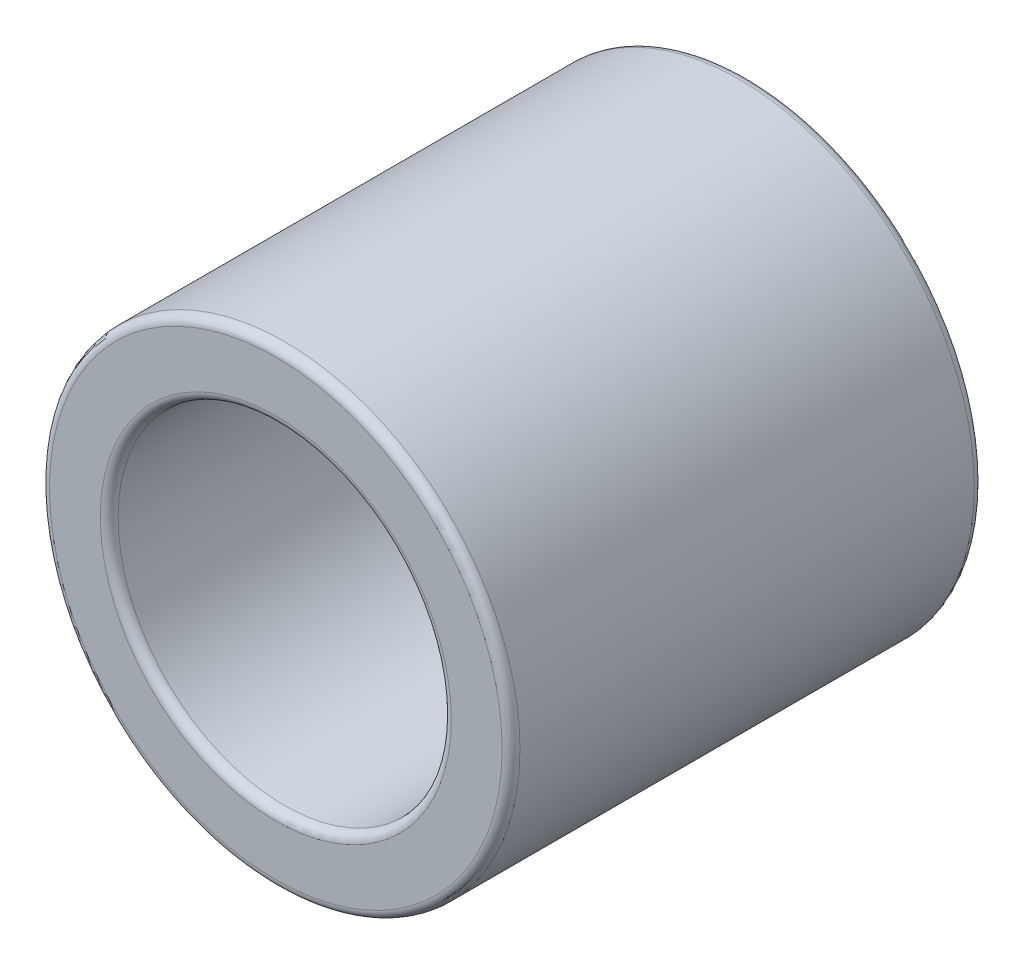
from build123d import *

# Parameters (mm, degrees)
SKETCH1_R           = 3.3528
SKETCH1_R_2         = 2.3749
BOSS_EXTRUDE1_DEPTH = 3.3655
FILLET1_R           = 0.127


with BuildPart() as part:
    # Sketch1 → Boss-Extrude1 (new, symmetric)
    with BuildSketch(Plane.XY):
        Circle(SKETCH1_R)
        Circle(SKETCH1_R_2, mode=Mode.SUBTRACT)
    extrude(amount=BOSS_EXTRUDE1_DEPTH, both=True)

    # Fillet1
    fillet1_edges = [part.edges().sort_by_distance(p)[0] for p in [
        (-3.3528, 0, -3.3655),
        (-3.3528, 0, 3.3655),
        (-2.3749, 0, -3.3655),
        (-2.3749, 0, 3.3655),
    ]]
    fillet(fillet1_edges, radius=FILLET1_R)


solid = part.part
